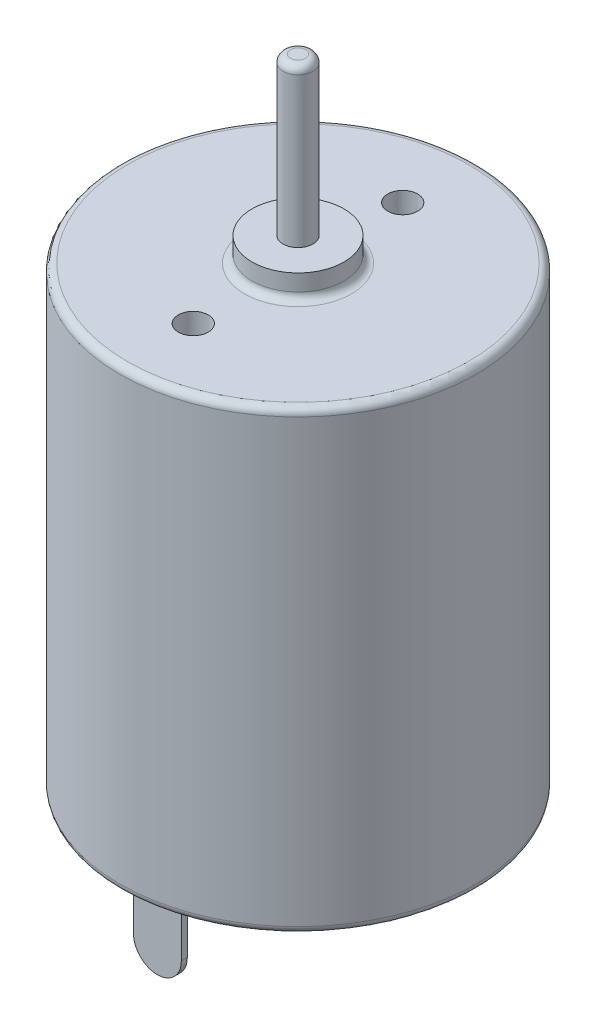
from build123d import *

# Parameters (mm, degrees)
SKETCH_1_R          = 11.9
EXTRUDE_1_DEPTH     = 30.5
EXTRUDE_2_DEPTH     = 1.5
EXTRUDE_3_DEPTH     = 6
CUT_EXTRUDE_1_DEPTH = 40.058289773
SKETCH_7_R          = 1
CUT_EXTRUDE_2_DEPTH = 5
SKETCH_8_R          = 3.075
EXTRUDE_4_DEPTH     = 1.6
SKETCH_9_R          = 1
EXTRUDE_5_DEPTH     = 10.5
FILLET_1_R          = 0.5
FILLET_2_R          = 0.5
FILLET_3_R          = 0.5


with BuildPart() as part:
    # Sketch 1 → Extrude 1 (new body)
    with BuildSketch(Plane(origin=(0, 0, 0), x_dir=(1, 0, 0), z_dir=(0, 1, 0))):
        with Locations(Location((0, 0, 0), (0, 0, 90))):
            Circle(SKETCH_1_R)
    extrude(amount=EXTRUDE_1_DEPTH)

    # Sketch 2 → Extrude 2 (add)
    with BuildSketch(Plane.XZ):
        with BuildLine():
            Line((3.75, -2), (3.75, 2))
            ThreePointArc((3.75, 2), (-4.25, 0), (3.75, -2))
        make_face()
    extrude(amount=EXTRUDE_2_DEPTH)

    # Sketch 5 → Extrude 3 (add)
    with BuildSketch(Plane.XZ):
        Polygon((0, 9), (1.6, 9), (1.6, 9.4), (-1.6, 9.4), (-1.6, 9), align=None)
        Polygon((-1.6, -9.4), (1.6, -9.4), (1.6, -9), (0, -9), (-1.6, -9), align=None)
    extrude(amount=EXTRUDE_3_DEPTH)

    # Sketch 6 → Cut-Extrude 1 (cut, through all)
    with BuildSketch(Plane(origin=(0, 0, -9.4), x_dir=(-1, 0, 0), z_dir=(0, 0, -1))):
        with BuildLine():
            ThreePointArc((1.6, -4.4), (1.13137085, -5.53137085), (0, -6))
            Line((0, -6), (1.6, -6))
            Line((1.6, -6), (1.6, -4.4))
        make_face()
        with BuildLine():
            ThreePointArc((0, -6), (-1.13137085, -5.53137085), (-1.6, -4.4))
            Line((-1.6, -4.4), (-1.6, -6))
            Line((-1.6, -6), (0, -6))
        make_face()
    extrude(amount=-CUT_EXTRUDE_1_DEPTH, mode=Mode.SUBTRACT)

    # Sketch 7 → Cut-Extrude 2 (cut)
    with BuildSketch(Plane(origin=(0, 30.5, 0), x_dir=(1, 0, 0), z_dir=(0, 1, 0))):
        with Locations(Location((0, 7, 0), (0, 0, 270))):
            Circle(SKETCH_7_R)
        with Locations(Location((0, -7, 0), (0, 0, 90))):
            Circle(SKETCH_7_R)
    extrude(amount=-CUT_EXTRUDE_2_DEPTH, mode=Mode.SUBTRACT)

    # Sketch 8 → Extrude 4 (add)
    with BuildSketch(Plane(origin=(0, 30.5, 0), x_dir=(1, 0, 0), z_dir=(0, 1, 0))):
        with Locations(Location((0, 0, 0), (0, 0, 270))):
            Circle(SKETCH_8_R)
    extrude(amount=EXTRUDE_4_DEPTH)

    # Sketch 9 → Extrude 5 (add)
    with BuildSketch(Plane(origin=(0, 32.1, 0), x_dir=(1, 0, 0), z_dir=(0, 1, 0))):
        with Locations(Location((0, 0, 0), (0, 0, 90))):
            Circle(SKETCH_9_R)
    extrude(amount=EXTRUDE_5_DEPTH)

    # Fillet 1
    fillet_1_edges = [part.edges().sort_by_distance(p)[0] for p in [
        (0, 30.5, -3.075),
    ]]
    fillet(fillet_1_edges, radius=FILLET_1_R)

    # Fillet 2
    fillet_2_edges = [part.edges().sort_by_distance(p)[0] for p in [
        (0, 0, 11.9),
        (0, 30.5, 11.9),
    ]]
    fillet(fillet_2_edges, radius=FILLET_2_R)

    # Fillet 3
    fillet_3_edges = [part.edges().sort_by_distance(p)[0] for p in [
        (0, 42.6, 1),
    ]]
    fillet(fillet_3_edges, radius=FILLET_3_R)


solid = part.part
